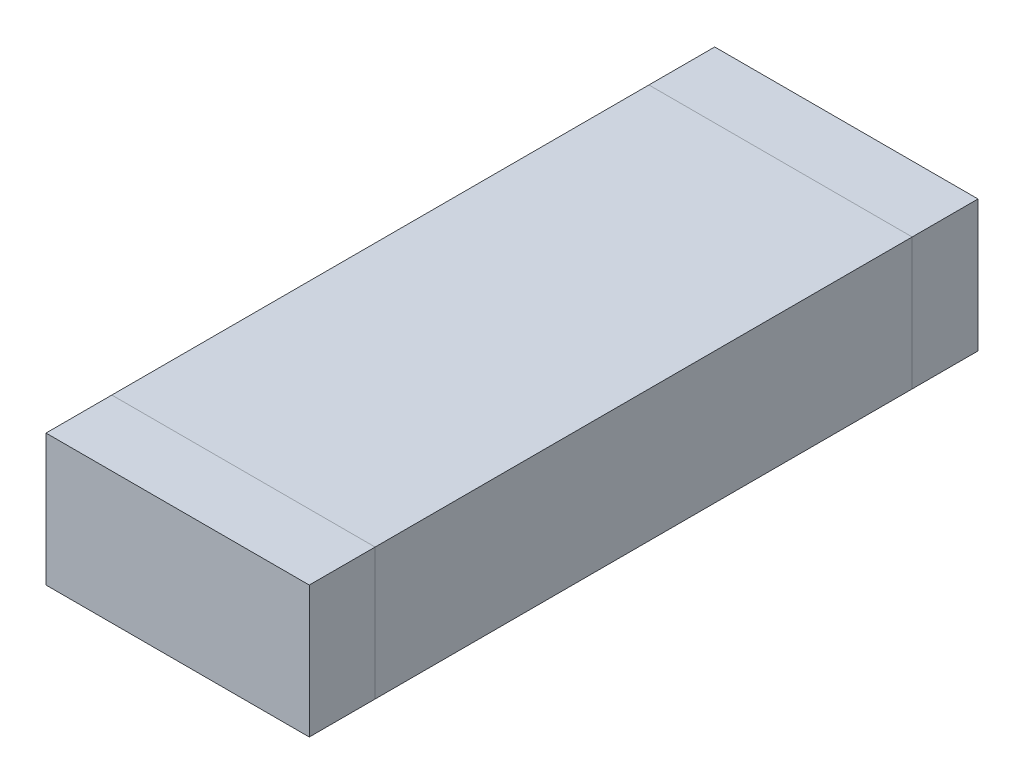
ISO-10303-21;
HEADER;
FILE_DESCRIPTION(('STEP AP214'),'2;1');
FILE_NAME('part.step','',(''),(''),'','','');
FILE_SCHEMA(('AUTOMOTIVE_DESIGN { 1 0 10303 214 1 1 1 1 }'));
ENDSEC;
DATA;
#1=APPLICATION_CONTEXT('core data for automotive mechanical design processes');
#2=APPLICATION_PROTOCOL_DEFINITION('international standard','automotive_design',2000,#1);
#3=PRODUCT_CONTEXT('',#1,'mechanical');
#4=PRODUCT('Part','Part','',(#3));
#5=PRODUCT_RELATED_PRODUCT_CATEGORY('part','',(#4));
#6=PRODUCT_DEFINITION_FORMATION('','',#4);
#7=PRODUCT_DEFINITION_CONTEXT('part definition',#1,'design');
#8=PRODUCT_DEFINITION('design','',#6,#7);
#9=PRODUCT_DEFINITION_SHAPE('','',#8);
#10=(LENGTH_UNIT() NAMED_UNIT(*) SI_UNIT(.MILLI.,.METRE.));
#11=(NAMED_UNIT(*) PLANE_ANGLE_UNIT() SI_UNIT($,.RADIAN.));
#12=(NAMED_UNIT(*) SI_UNIT($,.STERADIAN.) SOLID_ANGLE_UNIT());
#13=UNCERTAINTY_MEASURE_WITH_UNIT(LENGTH_MEASURE(1.E-05),#10,'distance_accuracy_value','');
#14=(GEOMETRIC_REPRESENTATION_CONTEXT(3) GLOBAL_UNCERTAINTY_ASSIGNED_CONTEXT((#13)) GLOBAL_UNIT_ASSIGNED_CONTEXT((#10,
#11,#12)) REPRESENTATION_CONTEXT('',''));
#15=CARTESIAN_POINT('',(0.,0.,0.));
#16=DIRECTION('',(0.,0.,1.));
#17=DIRECTION('',(1.,0.,0.));
#18=AXIS2_PLACEMENT_3D('',#15,#16,#17);
#19=CARTESIAN_POINT('',(-0.5,0.5,1.27));
#20=DIRECTION('',(1.,0.,0.));
#21=DIRECTION('',(0.,0.,-1.));
#22=AXIS2_PLACEMENT_3D('',#19,#20,#21);
#23=PLANE('',#22);
#24=DIRECTION('',(0.,1.,0.));
#25=VECTOR('',#24,1.);
#26=CARTESIAN_POINT('',(-0.5,0.5,1.02));
#27=LINE('',#26,#25);
#28=CARTESIAN_POINT('',(-0.5,0.,1.02));
#29=VERTEX_POINT('',#28);
#30=CARTESIAN_POINT('',(-0.5,0.5,1.02));
#31=VERTEX_POINT('',#30);
#32=EDGE_CURVE('E11',#29,#31,#27,.T.);
#33=ORIENTED_EDGE('',*,*,#32,.F.);
#34=DIRECTION('',(0.,0.,1.));
#35=VECTOR('',#34,1.);
#36=CARTESIAN_POINT('',(-0.5,0.,1.27));
#37=LINE('',#36,#35);
#38=CARTESIAN_POINT('',(-0.5,0.,1.27));
#39=VERTEX_POINT('',#38);
#40=EDGE_CURVE('E126',#29,#39,#37,.T.);
#41=ORIENTED_EDGE('',*,*,#40,.T.);
#42=DIRECTION('',(0.,-1.,0.));
#43=VECTOR('',#42,1.);
#44=CARTESIAN_POINT('',(-0.5,0.5,1.27));
#45=LINE('',#44,#43);
#46=CARTESIAN_POINT('',(-0.5,0.5,1.27));
#47=VERTEX_POINT('',#46);
#48=EDGE_CURVE('E120',#47,#39,#45,.T.);
#49=ORIENTED_EDGE('',*,*,#48,.F.);
#50=DIRECTION('',(0.,0.,1.));
#51=VECTOR('',#50,1.);
#52=CARTESIAN_POINT('',(-0.5,0.5,1.27));
#53=LINE('',#52,#51);
#54=EDGE_CURVE('E103',#31,#47,#53,.T.);
#55=ORIENTED_EDGE('',*,*,#54,.F.);
#56=EDGE_LOOP('',(#33,#41,#49,#55));
#57=FACE_BOUND('',#56,.T.);
#58=ADVANCED_FACE('F38',(#57),#23,.F.);
#59=DIRECTION('',(0.,-1.,0.));
#60=VECTOR('',#59,1.);
#61=CARTESIAN_POINT('',(-0.5,0.5,-1.02));
#62=LINE('',#61,#60);
#63=CARTESIAN_POINT('',(-0.5,0.5,-1.02));
#64=VERTEX_POINT('',#63);
#65=CARTESIAN_POINT('',(-0.5,0.,-1.02));
#66=VERTEX_POINT('',#65);
#67=EDGE_CURVE('E48',#64,#66,#62,.T.);
#68=ORIENTED_EDGE('',*,*,#67,.F.);
#69=CARTESIAN_POINT('',(-0.5,0.5,-1.27));
#70=VERTEX_POINT('',#69);
#71=EDGE_CURVE('E116',#70,#64,#53,.T.);
#72=ORIENTED_EDGE('',*,*,#71,.F.);
#73=DIRECTION('',(0.,-1.,0.));
#74=VECTOR('',#73,1.);
#75=CARTESIAN_POINT('',(-0.5,0.5,-1.27));
#76=LINE('',#75,#74);
#77=CARTESIAN_POINT('',(-0.5,0.,-1.27));
#78=VERTEX_POINT('',#77);
#79=EDGE_CURVE('E188',#70,#78,#76,.T.);
#80=ORIENTED_EDGE('',*,*,#79,.T.);
#81=EDGE_CURVE('E181',#78,#66,#37,.T.);
#82=ORIENTED_EDGE('',*,*,#81,.T.);
#83=EDGE_LOOP('',(#68,#72,#80,#82));
#84=FACE_BOUND('',#83,.T.);
#85=ADVANCED_FACE('F198',(#84),#23,.F.);
#86=CARTESIAN_POINT('',(0.5,0.5,1.27));
#87=DIRECTION('',(-1.,0.,0.));
#88=DIRECTION('',(0.,0.,1.));
#89=AXIS2_PLACEMENT_3D('',#86,#87,#88);
#90=PLANE('',#89);
#91=DIRECTION('',(0.,-1.,0.));
#92=VECTOR('',#91,1.);
#93=CARTESIAN_POINT('',(0.5,0.5,1.02));
#94=LINE('',#93,#92);
#95=CARTESIAN_POINT('',(0.5,0.5,1.02));
#96=VERTEX_POINT('',#95);
#97=CARTESIAN_POINT('',(0.5,0.,1.02));
#98=VERTEX_POINT('',#97);
#99=EDGE_CURVE('E138',#96,#98,#94,.T.);
#100=ORIENTED_EDGE('',*,*,#99,.F.);
#101=DIRECTION('',(0.,0.,-1.));
#102=VECTOR('',#101,1.);
#103=CARTESIAN_POINT('',(0.5,0.5,1.27));
#104=LINE('',#103,#102);
#105=CARTESIAN_POINT('',(0.5,0.5,1.27));
#106=VERTEX_POINT('',#105);
#107=EDGE_CURVE('E189',#106,#96,#104,.T.);
#108=ORIENTED_EDGE('',*,*,#107,.F.);
#109=DIRECTION('',(0.,-1.,0.));
#110=VECTOR('',#109,1.);
#111=CARTESIAN_POINT('',(0.5,0.5,1.27));
#112=LINE('',#111,#110);
#113=CARTESIAN_POINT('',(0.5,0.,1.27));
#114=VERTEX_POINT('',#113);
#115=EDGE_CURVE('E122',#106,#114,#112,.T.);
#116=ORIENTED_EDGE('',*,*,#115,.T.);
#117=DIRECTION('',(0.,0.,-1.));
#118=VECTOR('',#117,1.);
#119=CARTESIAN_POINT('',(0.5,0.,1.27));
#120=LINE('',#119,#118);
#121=EDGE_CURVE('E170',#114,#98,#120,.T.);
#122=ORIENTED_EDGE('',*,*,#121,.T.);
#123=EDGE_LOOP('',(#100,#108,#116,#122));
#124=FACE_BOUND('',#123,.T.);
#125=ADVANCED_FACE('F174',(#124),#90,.F.);
#126=DIRECTION('',(0.,1.,0.));
#127=VECTOR('',#126,1.);
#128=CARTESIAN_POINT('',(0.5,0.5,-1.02));
#129=LINE('',#128,#127);
#130=CARTESIAN_POINT('',(0.5,0.,-1.02));
#131=VERTEX_POINT('',#130);
#132=CARTESIAN_POINT('',(0.5,0.5,-1.02));
#133=VERTEX_POINT('',#132);
#134=EDGE_CURVE('E135',#131,#133,#129,.T.);
#135=ORIENTED_EDGE('',*,*,#134,.F.);
#136=CARTESIAN_POINT('',(0.5,0.,-1.27));
#137=VERTEX_POINT('',#136);
#138=EDGE_CURVE('E172',#131,#137,#120,.T.);
#139=ORIENTED_EDGE('',*,*,#138,.T.);
#140=DIRECTION('',(0.,-1.,0.));
#141=VECTOR('',#140,1.);
#142=CARTESIAN_POINT('',(0.5,0.5,-1.27));
#143=LINE('',#142,#141);
#144=CARTESIAN_POINT('',(0.5,0.5,-1.27));
#145=VERTEX_POINT('',#144);
#146=EDGE_CURVE('E131',#145,#137,#143,.T.);
#147=ORIENTED_EDGE('',*,*,#146,.F.);
#148=EDGE_CURVE('E124',#133,#145,#104,.T.);
#149=ORIENTED_EDGE('',*,*,#148,.F.);
#150=EDGE_LOOP('',(#135,#139,#147,#149));
#151=FACE_BOUND('',#150,.T.);
#152=ADVANCED_FACE('F205',(#151),#90,.F.);
#153=CARTESIAN_POINT('',(-0.5,0.5,-1.27));
#154=DIRECTION('',(0.,1.,0.));
#155=DIRECTION('',(0.,0.,1.));
#156=AXIS2_PLACEMENT_3D('',#153,#154,#155);
#157=PLANE('',#156);
#158=ORIENTED_EDGE('',*,*,#107,.T.);
#159=DIRECTION('',(-1.,0.,0.));
#160=VECTOR('',#159,1.);
#161=CARTESIAN_POINT('',(-0.5,0.5,1.02));
#162=LINE('',#161,#160);
#163=EDGE_CURVE('E110',#96,#31,#162,.T.);
#164=ORIENTED_EDGE('',*,*,#163,.T.);
#165=ORIENTED_EDGE('',*,*,#54,.T.);
#166=DIRECTION('',(1.,0.,0.));
#167=VECTOR('',#166,1.);
#168=CARTESIAN_POINT('',(0.5,0.5,1.27));
#169=LINE('',#168,#167);
#170=EDGE_CURVE('E107',#47,#106,#169,.T.);
#171=ORIENTED_EDGE('',*,*,#170,.T.);
#172=EDGE_LOOP('',(#158,#164,#165,#171));
#173=FACE_BOUND('',#172,.T.);
#174=ADVANCED_FACE('F106',(#173),#157,.T.);
#175=ORIENTED_EDGE('',*,*,#71,.T.);
#176=DIRECTION('',(1.,0.,0.));
#177=VECTOR('',#176,1.);
#178=CARTESIAN_POINT('',(-0.5,0.5,-1.02));
#179=LINE('',#178,#177);
#180=EDGE_CURVE('E42',#64,#133,#179,.T.);
#181=ORIENTED_EDGE('',*,*,#180,.T.);
#182=ORIENTED_EDGE('',*,*,#148,.T.);
#183=DIRECTION('',(-1.,0.,0.));
#184=VECTOR('',#183,1.);
#185=CARTESIAN_POINT('',(0.5,0.5,-1.27));
#186=LINE('',#185,#184);
#187=EDGE_CURVE('E186',#145,#70,#186,.T.);
#188=ORIENTED_EDGE('',*,*,#187,.T.);
#189=EDGE_LOOP('',(#175,#181,#182,#188));
#190=FACE_BOUND('',#189,.T.);
#191=ADVANCED_FACE('F206',(#190),#157,.T.);
#192=EDGE_CURVE('E183',#66,#29,#37,.T.);
#193=ORIENTED_EDGE('',*,*,#192,.T.);
#194=ORIENTED_EDGE('',*,*,#32,.T.);
#195=EDGE_CURVE('E113',#64,#31,#53,.T.);
#196=ORIENTED_EDGE('',*,*,#195,.F.);
#197=ORIENTED_EDGE('',*,*,#67,.T.);
#198=EDGE_LOOP('',(#193,#194,#196,#197));
#199=FACE_BOUND('',#198,.T.);
#200=ADVANCED_FACE('F40',(#199),#23,.F.);
#201=CARTESIAN_POINT('',(0.5,0.5,1.27));
#202=DIRECTION('',(0.,0.,-1.));
#203=DIRECTION('',(-1.,0.,0.));
#204=AXIS2_PLACEMENT_3D('',#201,#202,#203);
#205=PLANE('',#204);
#206=DIRECTION('',(1.,0.,0.));
#207=VECTOR('',#206,1.);
#208=CARTESIAN_POINT('',(0.5,0.,1.27));
#209=LINE('',#208,#207);
#210=EDGE_CURVE('E177',#39,#114,#209,.T.);
#211=ORIENTED_EDGE('',*,*,#210,.T.);
#212=ORIENTED_EDGE('',*,*,#115,.F.);
#213=ORIENTED_EDGE('',*,*,#170,.F.);
#214=ORIENTED_EDGE('',*,*,#48,.T.);
#215=EDGE_LOOP('',(#211,#212,#213,#214));
#216=FACE_BOUND('',#215,.T.);
#217=ADVANCED_FACE('F119',(#216),#205,.F.);
#218=EDGE_CURVE('E162',#96,#133,#104,.T.);
#219=ORIENTED_EDGE('',*,*,#218,.F.);
#220=ORIENTED_EDGE('',*,*,#99,.T.);
#221=EDGE_CURVE('E160',#98,#131,#120,.T.);
#222=ORIENTED_EDGE('',*,*,#221,.T.);
#223=ORIENTED_EDGE('',*,*,#134,.T.);
#224=EDGE_LOOP('',(#219,#220,#222,#223));
#225=FACE_BOUND('',#224,.T.);
#226=ADVANCED_FACE('F159',(#225),#90,.F.);
#227=CARTESIAN_POINT('',(0.5,0.5,-1.27));
#228=DIRECTION('',(0.,0.,1.));
#229=DIRECTION('',(1.,0.,0.));
#230=AXIS2_PLACEMENT_3D('',#227,#228,#229);
#231=PLANE('',#230);
#232=DIRECTION('',(-1.,0.,0.));
#233=VECTOR('',#232,1.);
#234=CARTESIAN_POINT('',(0.5,0.,-1.27));
#235=LINE('',#234,#233);
#236=EDGE_CURVE('E114',#137,#78,#235,.T.);
#237=ORIENTED_EDGE('',*,*,#236,.T.);
#238=ORIENTED_EDGE('',*,*,#79,.F.);
#239=ORIENTED_EDGE('',*,*,#187,.F.);
#240=ORIENTED_EDGE('',*,*,#146,.T.);
#241=EDGE_LOOP('',(#237,#238,#239,#240));
#242=FACE_BOUND('',#241,.T.);
#243=ADVANCED_FACE('F203',(#242),#231,.F.);
#244=ORIENTED_EDGE('',*,*,#163,.F.);
#245=ORIENTED_EDGE('',*,*,#218,.T.);
#246=ORIENTED_EDGE('',*,*,#180,.F.);
#247=ORIENTED_EDGE('',*,*,#195,.T.);
#248=EDGE_LOOP('',(#244,#245,#246,#247));
#249=FACE_BOUND('',#248,.T.);
#250=ADVANCED_FACE('F195',(#249),#157,.T.);
#251=CARTESIAN_POINT('',(-0.5,0.,-1.27));
#252=DIRECTION('',(0.,1.,0.));
#253=DIRECTION('',(0.,0.,1.));
#254=AXIS2_PLACEMENT_3D('',#251,#252,#253);
#255=PLANE('',#254);
#256=ORIENTED_EDGE('',*,*,#81,.F.);
#257=ORIENTED_EDGE('',*,*,#236,.F.);
#258=ORIENTED_EDGE('',*,*,#138,.F.);
#259=ORIENTED_EDGE('',*,*,#221,.F.);
#260=ORIENTED_EDGE('',*,*,#121,.F.);
#261=ORIENTED_EDGE('',*,*,#210,.F.);
#262=ORIENTED_EDGE('',*,*,#40,.F.);
#263=ORIENTED_EDGE('',*,*,#192,.F.);
#264=EDGE_LOOP('',(#256,#257,#258,#259,#260,#261,#262,#263));
#265=FACE_BOUND('',#264,.T.);
#266=ADVANCED_FACE('F169',(#265),#255,.F.);
#267=CLOSED_SHELL('',(#58,#85,#125,#152,#174,#191,#200,#217,#226,#243,#250,#266));
#268=MANIFOLD_SOLID_BREP('B2',#267);
#269=ADVANCED_BREP_SHAPE_REPRESENTATION('',(#18,#268),#14);
#270=SHAPE_DEFINITION_REPRESENTATION(#9,#269);
ENDSEC;
END-ISO-10303-21;
